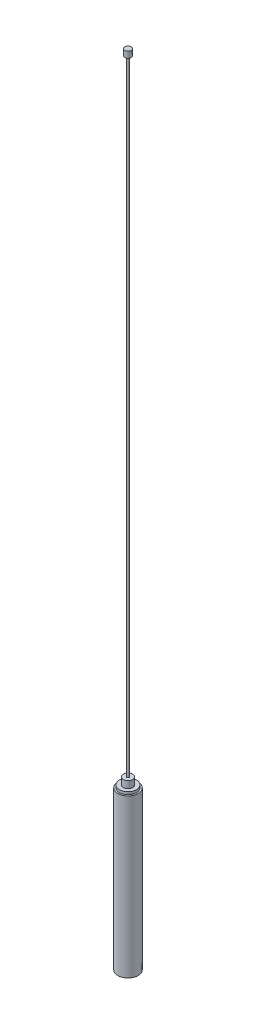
from build123d import *

# Parameters (mm, degrees)
CROQUIS1_R              = 16
SALIENTE_EXTRUIR1_DEPTH = 250
CROQUIS2_R              = 13.5
SALIENTE_EXTRUIR2_DEPTH = 4
CROQUIS3_R              = 7.534735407
SALIENTE_EXTRUIR3_DEPTH = 11
CROQUIS4_R              = 14.225859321
CORTAR_EXTRUIR1_DEPTH   = 248
CROQUIS5_R              = 1.751963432
CORTAR_EXTRUIR2_DEPTH   = 248
CROQUIS6_R              = 14.179869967
SALIENTE_EXTRUIR4_DEPTH = 4
CROQUIS7_R              = 1.5
SALIENTE_EXTRUIR5_DEPTH = 1000
CROQUIS8_R              = 5
SALIENTE_EXTRUIR6_DEPTH = 10


with BuildPart() as part:
    # Croquis1 → Saliente-Extruir1 (new body)
    with BuildSketch(Plane(origin=(0, 0, 0), x_dir=(1, 0, 0), z_dir=(0, 1, 0))):
        with Locations(Location((0, 0, 0), (0, 0, 270))):
            Circle(CROQUIS1_R)
    extrude(amount=SALIENTE_EXTRUIR1_DEPTH)

    # Croquis2 → Saliente-Extruir2 (add)
    with BuildSketch(Plane(origin=(0, 250, 0), x_dir=(1, 0, 0), z_dir=(0, 1, 0))):
        with Locations(Location((0, 0, 0), (0, 0, 270))):
            Circle(CROQUIS2_R)
    extrude(amount=SALIENTE_EXTRUIR2_DEPTH)

    # Croquis3 → Saliente-Extruir3 (add)
    with BuildSketch(Plane(origin=(0, 254, 0), x_dir=(1, 0, 0), z_dir=(0, 1, 0))):
        with Locations(Location((0, 0, 0), (0, 0, 270))):
            Circle(CROQUIS3_R)
    extrude(amount=SALIENTE_EXTRUIR3_DEPTH)

    # Croquis4 → Cortar-Extruir1 (cut)
    with BuildSketch(Plane.XZ):
        with Locations(Location((0, 0, 0), (0, 0, 270))):
            Circle(CROQUIS4_R)
    extrude(amount=-CORTAR_EXTRUIR1_DEPTH, mode=Mode.SUBTRACT)

    # Croquis5 → Cortar-Extruir2 (cut)
    with BuildSketch(Plane(origin=(0, 265, 0), x_dir=(1, 0, 0), z_dir=(0, 1, 0))):
        with Locations(Location((0, 0, 0), (0, 0, 270))):
            Circle(CROQUIS5_R)
    extrude(amount=-CORTAR_EXTRUIR2_DEPTH, mode=Mode.SUBTRACT)


with BuildPart() as body_2:
    # Croquis6 → Saliente-Extruir4 (new body)
    with BuildSketch(Plane(origin=(0, 1, 0), x_dir=(1, 0, 0), z_dir=(0, 1, 0))):
        with Locations(Location((0, 0, 0), (0, 0, 270))):
            Circle(CROQUIS6_R)
    extrude(amount=SALIENTE_EXTRUIR4_DEPTH)


with BuildPart() as body_3:
    # Croquis7 → Saliente-Extruir5 (new body)
    with BuildSketch(Plane(origin=(0, 265, 0), x_dir=(1, 0, 0), z_dir=(0, 1, 0))):
        with Locations(Location((0, 0, 0), (0, 0, 270))):
            Circle(CROQUIS7_R)
    extrude(amount=SALIENTE_EXTRUIR5_DEPTH)

    # Croquis8 → Saliente-Extruir6 (add)
    with BuildSketch(Plane(origin=(0, 1265, 0), x_dir=(1, 0, 0), z_dir=(0, 1, 0))):
        with Locations(Location((0, 0, 0), (0, 0, 270))):
            Circle(CROQUIS8_R)
    extrude(amount=-SALIENTE_EXTRUIR6_DEPTH)


solid = Compound([part.part, body_2.part, body_3.part])
